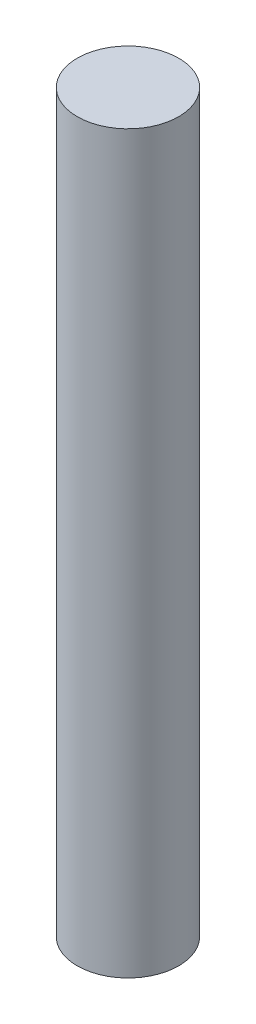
from build123d import *

# Parameters (mm, degrees)
SKETCH1_R      = 2.54
EXTRUDE1_DEPTH = 18.415


with BuildPart() as part:
    # Sketch1 → Extrude1 (new, symmetric)
    with BuildSketch(Plane(origin=(0, 0, 0), x_dir=(1, 0, 0), z_dir=(0, 1, 0))):
        with Locations(Location((0, 0, 0), (0, 0, 270))):
            Circle(SKETCH1_R)
    extrude(amount=EXTRUDE1_DEPTH, both=True)


solid = part.part
